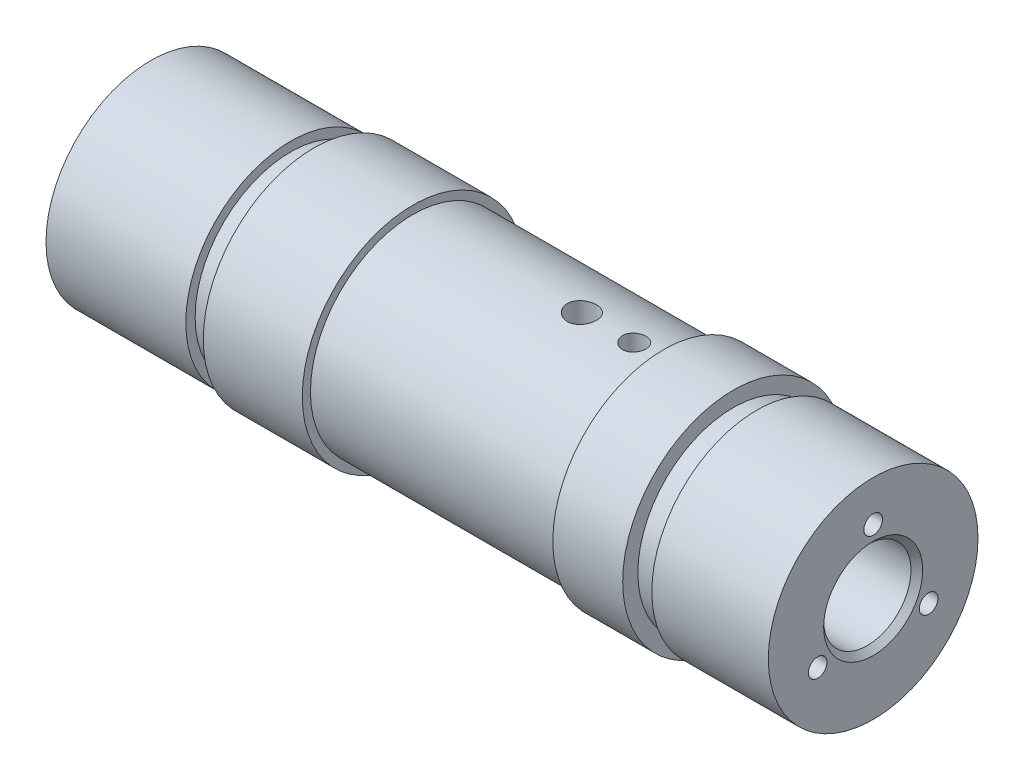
from build123d import *

# Parameters (mm, degrees)
SKIZZE2_R                       = 1
SCHNITT_LINEAR_AUSTRAGEN1_DEPTH = 15.5
M2_GEWINDEBOHRUNG1_D            = 1.6
M2_GEWINDEBOHRUNG1_DEPTH        = 7
M2_GEWINDEBOHRUNG1_TIP          = 0.480688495
M2_GEWINDEBOHRUNG2_D            = 1.6
M2_GEWINDEBOHRUNG2_DEPTH        = 7
M2_GEWINDEBOHRUNG2_TIP          = 0.480688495
SKIZZE8_W                       = 1.25
SKIZZE8_H                       = 9.5
FASE1_SIZE                      = 0.2
SKIZZE12_W                      = 2
SKIZZE12_H                      = 0.6
M2_GEWINDEBOHRUNG3_D            = 1.6
M2_GEWINDEBOHRUNG3_DEPTH        = 7
M2_GEWINDEBOHRUNG3_TIP          = 0.480688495


with BuildPart() as part:
    # Skizze1 → Rotation1 (revolve)
    with BuildSketch(Plane.XY, mode=Mode.PRIVATE) as rotation1_sk:
        Polygon((64.695, 9), (54.695, 9), (54.695, 8.2), (52.695, 8.2), (52.695, 9.5), (46.695, 9.5), (46.695, 8.8), (25.19, 8.8), (25.19, 9.5), (16.69, 9.5), (16.69, 8.2), (14.69, 8.2), (14.69, 9), (2.69, 9), (2.69, 3.65), (10.19, 3.65), (10.19, 3.2), (13.64, 3.2), (13.64, 3.6), (14.44, 3.6), (14.44, 3), (26.735341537, 3), (26.735341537, 2.5), (42.7, 2.5), (42.7, 3), (53.695, 3), (53.695, 3.75), (64.195, 3.75), (64.695, 4.25), align=None)
    revolve(rotation1_sk.sketch.rotate(Axis((0, 0, 0), (1, 0, 0)), 90), axis=Axis((0, 0, 0), (1, 0, 0)))

    # Skizze2 → Schnitt-Linear austragen1 (cut, symmetric)
    with BuildSketch(Plane(origin=(0, 0, 0), x_dir=(1, 0, 0), z_dir=(0, 1, 0))):
        with Locations(Location((44.19, 0, 0), (0, 0, 270))):
            Circle(SKIZZE2_R)
    extrude(amount=SCHNITT_LINEAR_AUSTRAGEN1_DEPTH, both=True, mode=Mode.SUBTRACT)

    # M2 Gewindebohrung1
    with Locations(Plane(origin=(64.695, 0, 0), x_dir=(0, 0, -1), z_dir=(1, 0, 0))):
        with Locations((-4.763139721, -2.75), (4.763139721, -2.75), (0, 5.5)):
            Hole(M2_GEWINDEBOHRUNG1_D / 2, depth=M2_GEWINDEBOHRUNG1_DEPTH)
            with Locations((0, 0, -(M2_GEWINDEBOHRUNG1_DEPTH + M2_GEWINDEBOHRUNG1_TIP / 2))):  # 118° drill point
                Cone(0, M2_GEWINDEBOHRUNG1_D / 2, M2_GEWINDEBOHRUNG1_TIP, mode=Mode.SUBTRACT)

    # M2 Gewindebohrung2
    with Locations(Plane.ZY.offset(-2.69)):
        with Locations((0, 6.25), (0, -6.25)):
            Hole(M2_GEWINDEBOHRUNG2_D / 2, depth=M2_GEWINDEBOHRUNG2_DEPTH)
            with Locations((0, 0, -(M2_GEWINDEBOHRUNG2_DEPTH + M2_GEWINDEBOHRUNG2_TIP / 2))):  # 118° drill point
                Cone(0, M2_GEWINDEBOHRUNG2_D / 2, M2_GEWINDEBOHRUNG2_TIP, mode=Mode.SUBTRACT)

    # Skizze8 → M3 Gewindebohrung1 (revolve, cut)
    with BuildSketch(Plane(origin=(39.69, 0, 0), x_dir=(0, 0, -1), z_dir=(1, 0, 0))):
        with Locations((0.625, 4.75)):
            Rectangle(SKIZZE8_W, SKIZZE8_H)
    revolve(axis=Axis((39.69, -6.35, 0), (0, 1, 0)), mode=Mode.SUBTRACT)

    # Fase1
    fase1_edges = [part.edges().sort_by_distance(p)[0] for p in [
        (53.695, 0, -3),
    ]]
    chamfer(fase1_edges, length=FASE1_SIZE)

    # Skizze12 → Schnitt-Rotation1 (revolve, cut)
    with BuildSketch(Plane.XY, mode=Mode.PRIVATE) as schnitt_rotation1_sk:
        with Locations((54.695, 3.8)):
            Rectangle(SKIZZE12_W, SKIZZE12_H)
    revolve(schnitt_rotation1_sk.sketch.rotate(Axis((0, 0, 0), (1, 0, 0)), 90), axis=Axis((0, 0, 0), (1, 0, 0)), mode=Mode.SUBTRACT)

    # M2 Gewindebohrung3
    with Locations(Plane.ZY.offset(-2.69)):
        with Locations((6, 0), (-6, 0)):
            Hole(M2_GEWINDEBOHRUNG3_D / 2, depth=M2_GEWINDEBOHRUNG3_DEPTH)
            with Locations((0, 0, -(M2_GEWINDEBOHRUNG3_DEPTH + M2_GEWINDEBOHRUNG3_TIP / 2))):  # 118° drill point
                Cone(0, M2_GEWINDEBOHRUNG3_D / 2, M2_GEWINDEBOHRUNG3_TIP, mode=Mode.SUBTRACT)


solid = part.part
